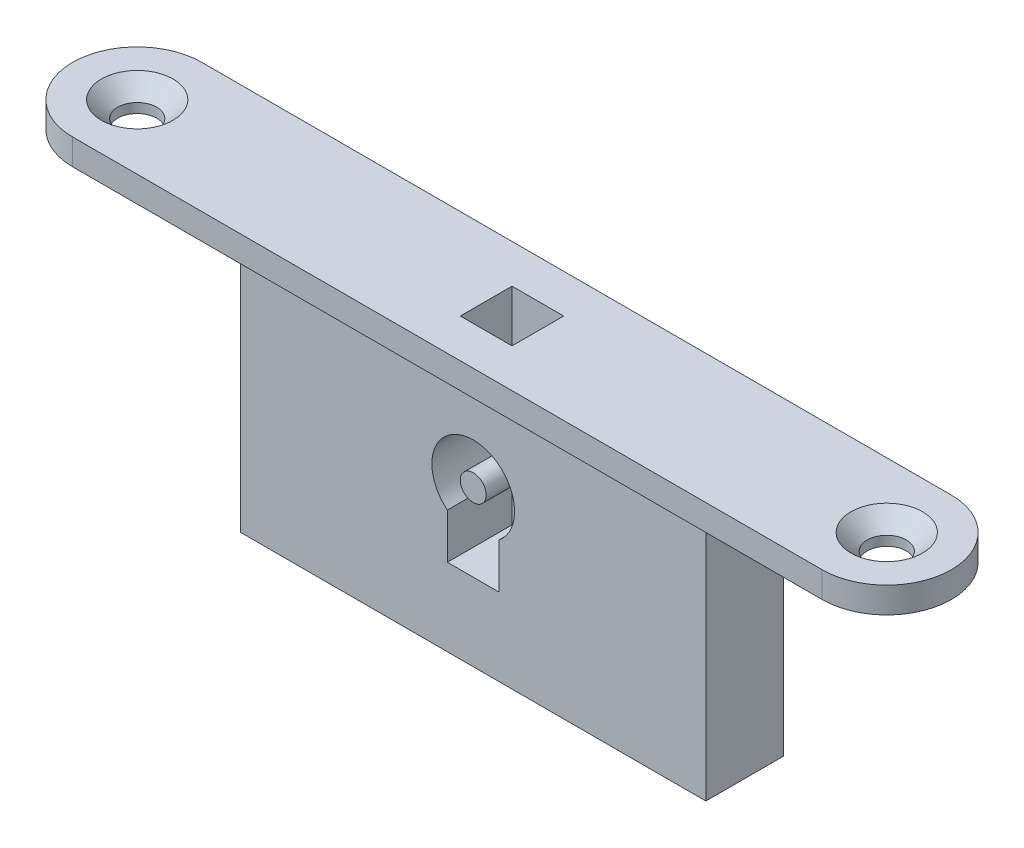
from build123d import *

# Parameters (mm, degrees)
EXTRUDE1_DEPTH                                  = 1.5875
SKETCH2_W                                       = 28.575
SKETCH2_H                                       = 4.7625
EXTRUDE2_DEPTH                                  = 15.875
SKETCH4_W                                       = 3.175
SKETCH4_H                                       = 3.175
EXTRUDE4_DEPTH                                  = 6.35
EXTRUDE3_REACH                                  = 34.766
CSK_FOR_M2_FLAT_HEAD_MACHINE_SCREW1_D           = 2.4
CSK_FOR_M2_FLAT_HEAD_MACHINE_SCREW1_CSINK_D     = 4.4
CSK_FOR_M2_FLAT_HEAD_MACHINE_SCREW1_CSINK_ANGLE = 90
SKETCH7_R                                       = 0.79375
EXTRUDE5_DEPTH                                  = 3.96875


with BuildPart() as part:
    # Sketch1 → Extrude1 (new body)
    with BuildSketch(Plane(origin=(0, 0, 0), x_dir=(1, 0, 0), z_dir=(0, 1, 0))):
        with BuildLine():
            Line((-23.01875, -3.96875), (23.01875, -3.96875))
            ThreePointArc((23.01875, -3.96875), (26.9875, 0), (23.01875, 3.96875))
            Line((23.01875, 3.96875), (-23.01875, 3.96875))
            ThreePointArc((-23.01875, 3.96875), (-26.9875, 0), (-23.01875, -3.96875))
        make_face()
    extrude(amount=-EXTRUDE1_DEPTH)

    # Sketch2 → Extrude2 (add)
    with BuildSketch(Plane.XZ.offset(1.5875)):
        Rectangle(SKETCH2_W, SKETCH2_H)
    extrude(amount=EXTRUDE2_DEPTH)

    # Sketch4 → Extrude4 (cut)
    with BuildSketch(Plane(origin=(0, 0, 0), x_dir=(1, 0, 0), z_dir=(0, 1, 0))):
        Rectangle(SKETCH4_W, SKETCH4_H)
    extrude(amount=-EXTRUDE4_DEPTH, mode=Mode.SUBTRACT)

    # Extrude3: up to this face of the body (flat: up to its plane)
    extrude3_end = Plane(part.part.faces().sort_by_distance((0, -3.175, -1.5875))[0])
    # Sketch3 → Extrude3 (cut, up to the picked face)
    with BuildSketch(Plane.XY.offset(2.38125), mode=Mode.PRIVATE) as extrude3_sk1:
        with BuildLine():
            Line((1.5875, -9.920286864), (1.5875, -12.7))
            Line((1.5875, -12.7), (-1.5875, -12.7))
            Line((-1.5875, -12.7), (-1.5875, -9.920286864))
            ThreePointArc((-1.5875, -9.920286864), (0, -5.3975), (1.5875, -9.920286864))
        make_face()
    extrude3_tool1 = split(extrude(extrude3_sk1.sketch, amount=-EXTRUDE3_REACH, mode=Mode.PRIVATE), bisect_by=extrude3_end, keep=Keep.BOTH, mode=Mode.PRIVATE)
    add(extrude3_tool1.solids().sort_by(Axis((0, -8.90926, 2.38125), (0, 0, -1)))[0], mode=Mode.SUBTRACT)

    # CSK for M2 Flat Head Machine Screw1 (through all)
    with Locations(Plane(origin=(0, 0, 0), x_dir=(-1, 0, 0), z_dir=(0, 1, 0))):
        with Locations((-23.01875, 0), (23.01875, 0)):
            CounterSinkHole(CSK_FOR_M2_FLAT_HEAD_MACHINE_SCREW1_D / 2, CSK_FOR_M2_FLAT_HEAD_MACHINE_SCREW1_CSINK_D / 2, counter_sink_angle=CSK_FOR_M2_FLAT_HEAD_MACHINE_SCREW1_CSINK_ANGLE)

    # Sketch7 → Extrude5 (add)
    with BuildSketch(Plane.XY.offset(-1.5875)):
        with Locations(Location((0, -7.9375, 0), (0, 0, 180))):
            Circle(SKETCH7_R)
    extrude(amount=EXTRUDE5_DEPTH)


solid = part.part
